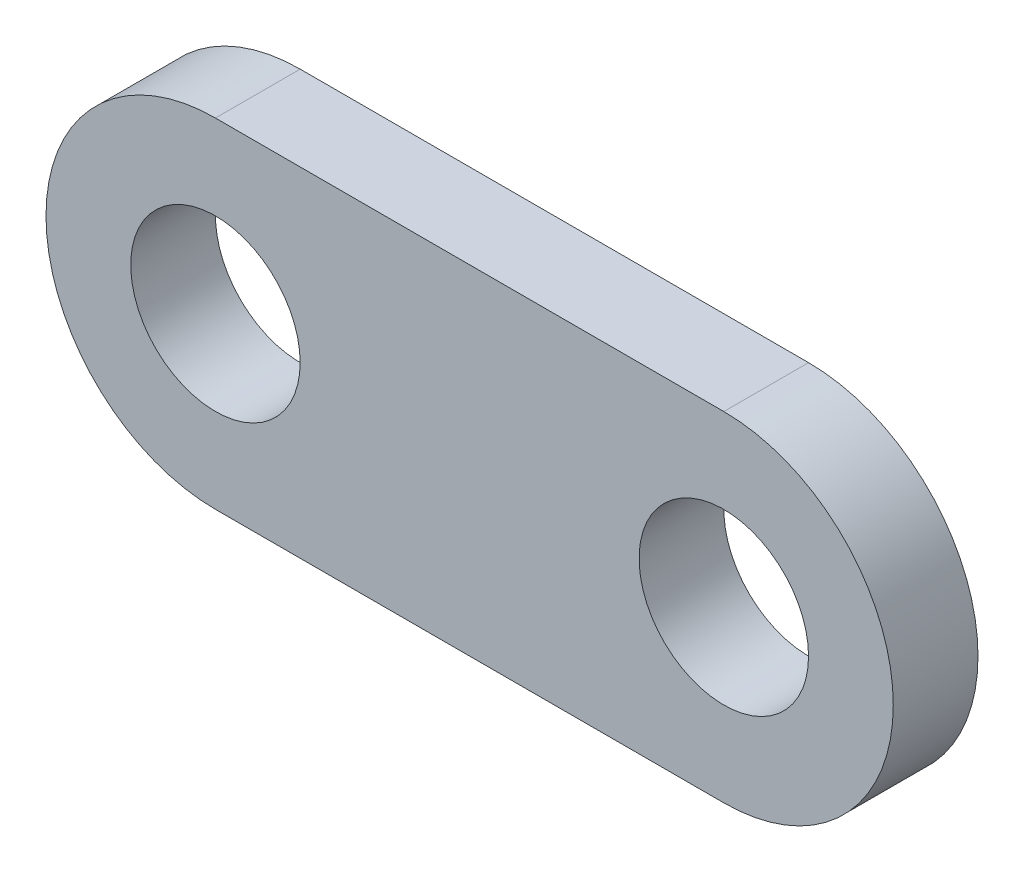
ISO-10303-21;
HEADER;
FILE_DESCRIPTION(('STEP AP214'),'2;1');
FILE_NAME('part.step','',(''),(''),'','','');
FILE_SCHEMA(('AUTOMOTIVE_DESIGN { 1 0 10303 214 1 1 1 1 }'));
ENDSEC;
DATA;
#1=APPLICATION_CONTEXT('core data for automotive mechanical design processes');
#2=APPLICATION_PROTOCOL_DEFINITION('international standard','automotive_design',2000,#1);
#3=PRODUCT_CONTEXT('',#1,'mechanical');
#4=PRODUCT('Part','Part','',(#3));
#5=PRODUCT_RELATED_PRODUCT_CATEGORY('part','',(#4));
#6=PRODUCT_DEFINITION_FORMATION('','',#4);
#7=PRODUCT_DEFINITION_CONTEXT('part definition',#1,'design');
#8=PRODUCT_DEFINITION('design','',#6,#7);
#9=PRODUCT_DEFINITION_SHAPE('','',#8);
#10=(LENGTH_UNIT() NAMED_UNIT(*) SI_UNIT(.MILLI.,.METRE.));
#11=(NAMED_UNIT(*) PLANE_ANGLE_UNIT() SI_UNIT($,.RADIAN.));
#12=(NAMED_UNIT(*) SI_UNIT($,.STERADIAN.) SOLID_ANGLE_UNIT());
#13=UNCERTAINTY_MEASURE_WITH_UNIT(LENGTH_MEASURE(1.E-05),#10,'distance_accuracy_value','');
#14=(GEOMETRIC_REPRESENTATION_CONTEXT(3) GLOBAL_UNCERTAINTY_ASSIGNED_CONTEXT((#13)) GLOBAL_UNIT_ASSIGNED_CONTEXT((#10,
#11,#12)) REPRESENTATION_CONTEXT('',''));
#15=CARTESIAN_POINT('',(0.,0.,0.));
#16=DIRECTION('',(0.,0.,1.));
#17=DIRECTION('',(1.,0.,0.));
#18=AXIS2_PLACEMENT_3D('',#15,#16,#17);
#19=CARTESIAN_POINT('',(-19.05,0.,6.35));
#20=DIRECTION('',(0.,0.,-1.));
#21=DIRECTION('',(-1.,0.,0.));
#22=AXIS2_PLACEMENT_3D('',#19,#20,#21);
#23=PLANE('',#22);
#24=CARTESIAN_POINT('',(19.05,0.,6.35));
#25=DIRECTION('',(0.,0.,1.));
#26=DIRECTION('',(1.,0.,0.));
#27=AXIS2_PLACEMENT_3D('',#24,#25,#26);
#28=CIRCLE('',#27,6.35);
#29=CARTESIAN_POINT('',(25.4,0.,6.35));
#30=VERTEX_POINT('',#29);
#31=EDGE_CURVE('E99',#30,#30,#28,.T.);
#32=ORIENTED_EDGE('',*,*,#31,.F.);
#33=EDGE_LOOP('',(#32));
#34=FACE_BOUND('',#33,.T.);
#35=CARTESIAN_POINT('',(-19.05,0.,6.35));
#36=DIRECTION('',(0.,0.,1.));
#37=DIRECTION('',(-1.,0.,0.));
#38=AXIS2_PLACEMENT_3D('',#35,#36,#37);
#39=CIRCLE('',#38,12.7);
#40=CARTESIAN_POINT('',(-19.05,12.7,6.35));
#41=VERTEX_POINT('',#40);
#42=CARTESIAN_POINT('',(-19.05,-12.7,6.35));
#43=VERTEX_POINT('',#42);
#44=EDGE_CURVE('E84',#41,#43,#39,.T.);
#45=ORIENTED_EDGE('',*,*,#44,.T.);
#46=DIRECTION('',(1.,0.,0.));
#47=VECTOR('',#46,1.);
#48=CARTESIAN_POINT('',(-19.05,-12.7,6.35));
#49=LINE('',#48,#47);
#50=CARTESIAN_POINT('',(19.05,-12.7,6.35));
#51=VERTEX_POINT('',#50);
#52=EDGE_CURVE('E79',#43,#51,#49,.T.);
#53=ORIENTED_EDGE('',*,*,#52,.T.);
#54=CARTESIAN_POINT('',(19.05,0.,6.35));
#55=DIRECTION('',(0.,0.,1.));
#56=DIRECTION('',(-1.,0.,0.));
#57=AXIS2_PLACEMENT_3D('',#54,#55,#56);
#58=CIRCLE('',#57,12.7);
#59=CARTESIAN_POINT('',(19.05,12.7,6.35));
#60=VERTEX_POINT('',#59);
#61=EDGE_CURVE('E82',#51,#60,#58,.T.);
#62=ORIENTED_EDGE('',*,*,#61,.T.);
#63=DIRECTION('',(-1.,0.,0.));
#64=VECTOR('',#63,1.);
#65=CARTESIAN_POINT('',(-19.05,12.7,6.35));
#66=LINE('',#65,#64);
#67=EDGE_CURVE('E49',#60,#41,#66,.T.);
#68=ORIENTED_EDGE('',*,*,#67,.T.);
#69=EDGE_LOOP('',(#45,#53,#62,#68));
#70=FACE_BOUND('',#69,.T.);
#71=CARTESIAN_POINT('',(-19.05,0.,6.35));
#72=DIRECTION('',(0.,0.,1.));
#73=DIRECTION('',(1.,0.,0.));
#74=AXIS2_PLACEMENT_3D('',#71,#72,#73);
#75=CIRCLE('',#74,6.35);
#76=CARTESIAN_POINT('',(-12.7,0.,6.35));
#77=VERTEX_POINT('',#76);
#78=EDGE_CURVE('E114',#77,#77,#75,.T.);
#79=ORIENTED_EDGE('',*,*,#78,.F.);
#80=EDGE_LOOP('',(#79));
#81=FACE_BOUND('',#80,.T.);
#82=ADVANCED_FACE('F32',(#34,#70,#81),#23,.F.);
#83=CARTESIAN_POINT('',(-19.05,0.,0.));
#84=DIRECTION('',(0.,0.,-1.));
#85=DIRECTION('',(-1.,0.,0.));
#86=AXIS2_PLACEMENT_3D('',#83,#84,#85);
#87=PLANE('',#86);
#88=CARTESIAN_POINT('',(19.05,0.,0.));
#89=DIRECTION('',(0.,0.,1.));
#90=DIRECTION('',(1.,0.,0.));
#91=AXIS2_PLACEMENT_3D('',#88,#89,#90);
#92=CIRCLE('',#91,6.35);
#93=CARTESIAN_POINT('',(25.4,0.,0.));
#94=VERTEX_POINT('',#93);
#95=EDGE_CURVE('E111',#94,#94,#92,.T.);
#96=ORIENTED_EDGE('',*,*,#95,.T.);
#97=EDGE_LOOP('',(#96));
#98=FACE_BOUND('',#97,.T.);
#99=CARTESIAN_POINT('',(-19.05,0.,0.));
#100=DIRECTION('',(0.,0.,1.));
#101=DIRECTION('',(-1.,0.,0.));
#102=AXIS2_PLACEMENT_3D('',#99,#100,#101);
#103=CIRCLE('',#102,12.7);
#104=CARTESIAN_POINT('',(-19.05,12.7,0.));
#105=VERTEX_POINT('',#104);
#106=CARTESIAN_POINT('',(-19.05,-12.7,0.));
#107=VERTEX_POINT('',#106);
#108=EDGE_CURVE('E96',#105,#107,#103,.T.);
#109=ORIENTED_EDGE('',*,*,#108,.F.);
#110=DIRECTION('',(-1.,0.,0.));
#111=VECTOR('',#110,1.);
#112=CARTESIAN_POINT('',(-19.05,12.7,0.));
#113=LINE('',#112,#111);
#114=CARTESIAN_POINT('',(19.05,12.7,0.));
#115=VERTEX_POINT('',#114);
#116=EDGE_CURVE('E72',#115,#105,#113,.T.);
#117=ORIENTED_EDGE('',*,*,#116,.F.);
#118=CARTESIAN_POINT('',(19.05,0.,0.));
#119=DIRECTION('',(0.,0.,1.));
#120=DIRECTION('',(-1.,0.,0.));
#121=AXIS2_PLACEMENT_3D('',#118,#119,#120);
#122=CIRCLE('',#121,12.7);
#123=CARTESIAN_POINT('',(19.05,-12.7,0.));
#124=VERTEX_POINT('',#123);
#125=EDGE_CURVE('E66',#124,#115,#122,.T.);
#126=ORIENTED_EDGE('',*,*,#125,.F.);
#127=DIRECTION('',(1.,0.,0.));
#128=VECTOR('',#127,1.);
#129=CARTESIAN_POINT('',(-19.05,-12.7,0.));
#130=LINE('',#129,#128);
#131=EDGE_CURVE('E88',#107,#124,#130,.T.);
#132=ORIENTED_EDGE('',*,*,#131,.F.);
#133=EDGE_LOOP('',(#109,#117,#126,#132));
#134=FACE_BOUND('',#133,.T.);
#135=CARTESIAN_POINT('',(-19.05,0.,0.));
#136=DIRECTION('',(0.,0.,1.));
#137=DIRECTION('',(1.,0.,0.));
#138=AXIS2_PLACEMENT_3D('',#135,#136,#137);
#139=CIRCLE('',#138,6.35);
#140=CARTESIAN_POINT('',(-12.7,0.,0.));
#141=VERTEX_POINT('',#140);
#142=EDGE_CURVE('E117',#141,#141,#139,.T.);
#143=ORIENTED_EDGE('',*,*,#142,.T.);
#144=EDGE_LOOP('',(#143));
#145=FACE_BOUND('',#144,.T.);
#146=ADVANCED_FACE('F107',(#98,#134,#145),#87,.T.);
#147=CARTESIAN_POINT('',(-19.05,0.,6.35));
#148=DIRECTION('',(0.,0.,-1.));
#149=DIRECTION('',(-1.,0.,0.));
#150=AXIS2_PLACEMENT_3D('',#147,#148,#149);
#151=CYLINDRICAL_SURFACE('',#150,12.7);
#152=ORIENTED_EDGE('',*,*,#108,.T.);
#153=DIRECTION('',(0.,0.,-1.));
#154=VECTOR('',#153,1.);
#155=CARTESIAN_POINT('',(-19.05,-12.7,6.35));
#156=LINE('',#155,#154);
#157=EDGE_CURVE('E11',#43,#107,#156,.T.);
#158=ORIENTED_EDGE('',*,*,#157,.F.);
#159=ORIENTED_EDGE('',*,*,#44,.F.);
#160=DIRECTION('',(0.,0.,-1.));
#161=VECTOR('',#160,1.);
#162=CARTESIAN_POINT('',(-19.05,12.7,6.35));
#163=LINE('',#162,#161);
#164=EDGE_CURVE('E92',#41,#105,#163,.T.);
#165=ORIENTED_EDGE('',*,*,#164,.T.);
#166=EDGE_LOOP('',(#152,#158,#159,#165));
#167=FACE_BOUND('',#166,.T.);
#168=ADVANCED_FACE('F34',(#167),#151,.T.);
#169=CARTESIAN_POINT('',(-19.05,-12.7,6.35));
#170=DIRECTION('',(0.,1.,0.));
#171=DIRECTION('',(-1.,0.,0.));
#172=AXIS2_PLACEMENT_3D('',#169,#170,#171);
#173=PLANE('',#172);
#174=ORIENTED_EDGE('',*,*,#131,.T.);
#175=DIRECTION('',(0.,0.,-1.));
#176=VECTOR('',#175,1.);
#177=CARTESIAN_POINT('',(19.05,-12.7,6.35));
#178=LINE('',#177,#176);
#179=EDGE_CURVE('E41',#51,#124,#178,.T.);
#180=ORIENTED_EDGE('',*,*,#179,.F.);
#181=ORIENTED_EDGE('',*,*,#52,.F.);
#182=ORIENTED_EDGE('',*,*,#157,.T.);
#183=EDGE_LOOP('',(#174,#180,#181,#182));
#184=FACE_BOUND('',#183,.T.);
#185=ADVANCED_FACE('F87',(#184),#173,.F.);
#186=CARTESIAN_POINT('',(19.05,0.,6.35));
#187=DIRECTION('',(0.,0.,-1.));
#188=DIRECTION('',(-1.,0.,0.));
#189=AXIS2_PLACEMENT_3D('',#186,#187,#188);
#190=CYLINDRICAL_SURFACE('',#189,12.7);
#191=ORIENTED_EDGE('',*,*,#125,.T.);
#192=DIRECTION('',(0.,0.,-1.));
#193=VECTOR('',#192,1.);
#194=CARTESIAN_POINT('',(19.05,12.7,6.35));
#195=LINE('',#194,#193);
#196=EDGE_CURVE('E89',#60,#115,#195,.T.);
#197=ORIENTED_EDGE('',*,*,#196,.F.);
#198=ORIENTED_EDGE('',*,*,#61,.F.);
#199=ORIENTED_EDGE('',*,*,#179,.T.);
#200=EDGE_LOOP('',(#191,#197,#198,#199));
#201=FACE_BOUND('',#200,.T.);
#202=ADVANCED_FACE('F90',(#201),#190,.T.);
#203=CARTESIAN_POINT('',(-19.05,12.7,6.35));
#204=DIRECTION('',(0.,-1.,0.));
#205=DIRECTION('',(1.,0.,0.));
#206=AXIS2_PLACEMENT_3D('',#203,#204,#205);
#207=PLANE('',#206);
#208=ORIENTED_EDGE('',*,*,#116,.T.);
#209=ORIENTED_EDGE('',*,*,#164,.F.);
#210=ORIENTED_EDGE('',*,*,#67,.F.);
#211=ORIENTED_EDGE('',*,*,#196,.T.);
#212=EDGE_LOOP('',(#208,#209,#210,#211));
#213=FACE_BOUND('',#212,.T.);
#214=ADVANCED_FACE('F104',(#213),#207,.F.);
#215=CARTESIAN_POINT('',(19.05,0.,6.35));
#216=DIRECTION('',(0.,0.,-1.));
#217=DIRECTION('',(-1.,0.,0.));
#218=AXIS2_PLACEMENT_3D('',#215,#216,#217);
#219=CYLINDRICAL_SURFACE('',#218,6.35);
#220=ORIENTED_EDGE('',*,*,#31,.T.);
#221=EDGE_LOOP('',(#220));
#222=FACE_BOUND('',#221,.T.);
#223=ORIENTED_EDGE('',*,*,#95,.F.);
#224=EDGE_LOOP('',(#223));
#225=FACE_BOUND('',#224,.T.);
#226=ADVANCED_FACE('F135',(#222,#225),#219,.F.);
#227=CARTESIAN_POINT('',(-19.05,0.,6.35));
#228=DIRECTION('',(0.,0.,-1.));
#229=DIRECTION('',(-1.,0.,0.));
#230=AXIS2_PLACEMENT_3D('',#227,#228,#229);
#231=CYLINDRICAL_SURFACE('',#230,6.35);
#232=ORIENTED_EDGE('',*,*,#78,.T.);
#233=EDGE_LOOP('',(#232));
#234=FACE_BOUND('',#233,.T.);
#235=ORIENTED_EDGE('',*,*,#142,.F.);
#236=EDGE_LOOP('',(#235));
#237=FACE_BOUND('',#236,.T.);
#238=ADVANCED_FACE('F123',(#234,#237),#231,.F.);
#239=CLOSED_SHELL('',(#82,#146,#168,#185,#202,#214,#226,#238));
#240=MANIFOLD_SOLID_BREP('B2',#239);
#241=ADVANCED_BREP_SHAPE_REPRESENTATION('',(#18,#240),#14);
#242=SHAPE_DEFINITION_REPRESENTATION(#9,#241);
ENDSEC;
END-ISO-10303-21;
